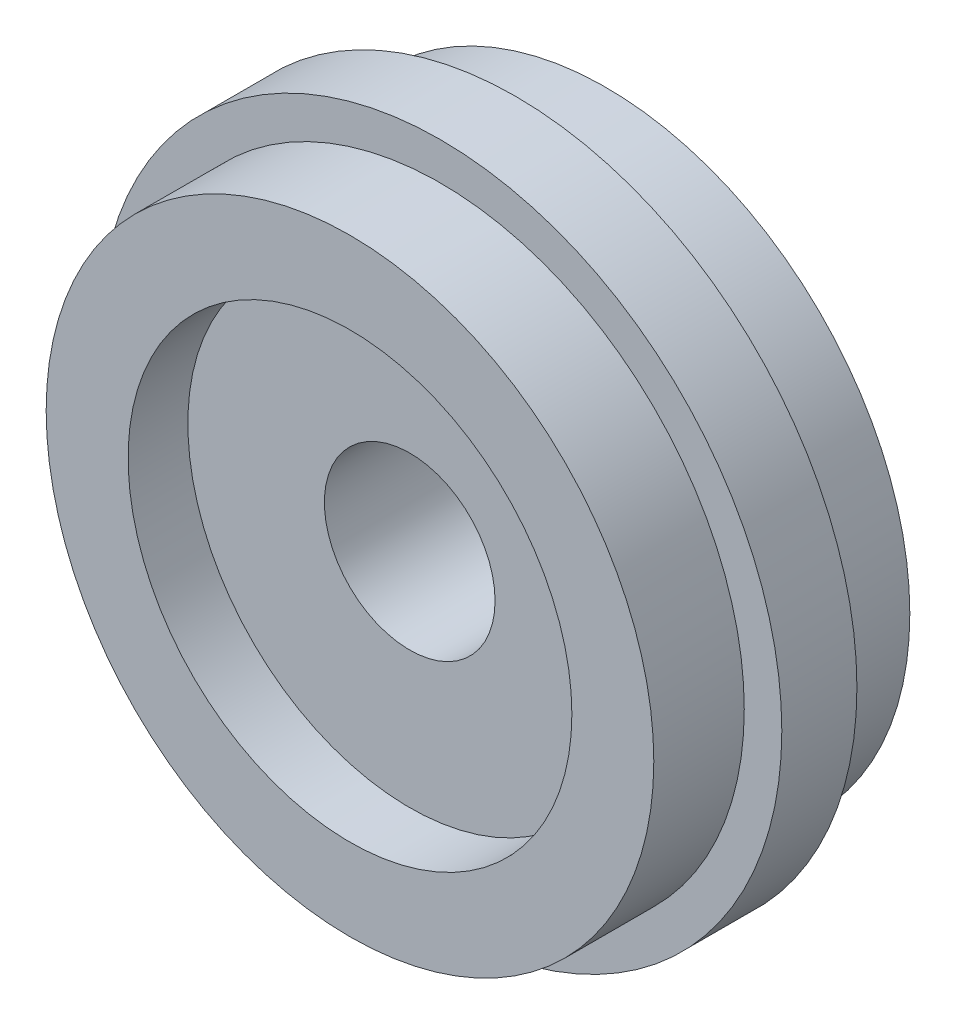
ISO-10303-21;
HEADER;
FILE_DESCRIPTION(('STEP AP214'),'2;1');
FILE_NAME('part.step','',(''),(''),'','','');
FILE_SCHEMA(('AUTOMOTIVE_DESIGN { 1 0 10303 214 1 1 1 1 }'));
ENDSEC;
DATA;
#1=APPLICATION_CONTEXT('core data for automotive mechanical design processes');
#2=APPLICATION_PROTOCOL_DEFINITION('international standard','automotive_design',2000,#1);
#3=PRODUCT_CONTEXT('',#1,'mechanical');
#4=PRODUCT('Part','Part','',(#3));
#5=PRODUCT_RELATED_PRODUCT_CATEGORY('part','',(#4));
#6=PRODUCT_DEFINITION_FORMATION('','',#4);
#7=PRODUCT_DEFINITION_CONTEXT('part definition',#1,'design');
#8=PRODUCT_DEFINITION('design','',#6,#7);
#9=PRODUCT_DEFINITION_SHAPE('','',#8);
#10=(LENGTH_UNIT() NAMED_UNIT(*) SI_UNIT(.MILLI.,.METRE.));
#11=(NAMED_UNIT(*) PLANE_ANGLE_UNIT() SI_UNIT($,.RADIAN.));
#12=(NAMED_UNIT(*) SI_UNIT($,.STERADIAN.) SOLID_ANGLE_UNIT());
#13=UNCERTAINTY_MEASURE_WITH_UNIT(LENGTH_MEASURE(1.E-05),#10,'distance_accuracy_value','');
#14=(GEOMETRIC_REPRESENTATION_CONTEXT(3) GLOBAL_UNCERTAINTY_ASSIGNED_CONTEXT((#13)) GLOBAL_UNIT_ASSIGNED_CONTEXT((#10,
#11,#12)) REPRESENTATION_CONTEXT('',''));
#15=CARTESIAN_POINT('',(0.,0.,0.));
#16=DIRECTION('',(0.,0.,1.));
#17=DIRECTION('',(1.,0.,0.));
#18=AXIS2_PLACEMENT_3D('',#15,#16,#17);
#19=CARTESIAN_POINT('',(0.,20.,7.5));
#20=DIRECTION('',(0.,0.,-1.));
#21=DIRECTION('',(-1.,0.,0.));
#22=AXIS2_PLACEMENT_3D('',#19,#20,#21);
#23=PLANE('',#22);
#24=CARTESIAN_POINT('',(0.,0.,7.5));
#25=DIRECTION('',(0.,0.,1.));
#26=DIRECTION('',(1.,0.,0.));
#27=AXIS2_PLACEMENT_3D('',#24,#25,#26);
#28=CIRCLE('',#27,13.);
#29=CARTESIAN_POINT('',(13.,0.,7.5));
#30=VERTEX_POINT('',#29);
#31=EDGE_CURVE('E8',#30,#30,#28,.T.);
#32=ORIENTED_EDGE('',*,*,#31,.F.);
#33=EDGE_LOOP('',(#32));
#34=FACE_BOUND('',#33,.T.);
#35=CARTESIAN_POINT('',(0.,0.,7.5));
#36=DIRECTION('',(0.,0.,-1.));
#37=DIRECTION('',(-1.,0.,0.));
#38=AXIS2_PLACEMENT_3D('',#35,#36,#37);
#39=CIRCLE('',#38,17.8);
#40=CARTESIAN_POINT('',(-17.8,0.,7.5));
#41=VERTEX_POINT('',#40);
#42=EDGE_CURVE('E15',#41,#41,#39,.T.);
#43=ORIENTED_EDGE('',*,*,#42,.F.);
#44=EDGE_LOOP('',(#43));
#45=FACE_BOUND('',#44,.T.);
#46=ADVANCED_FACE('F12',(#34,#45),#23,.F.);
#47=CARTESIAN_POINT('',(0.,11.,-7.5));
#48=DIRECTION('',(0.,0.,1.));
#49=DIRECTION('',(1.,0.,0.));
#50=AXIS2_PLACEMENT_3D('',#47,#48,#49);
#51=PLANE('',#50);
#52=CARTESIAN_POINT('',(0.,0.,-7.5));
#53=DIRECTION('',(0.,0.,1.));
#54=DIRECTION('',(1.,0.,0.));
#55=AXIS2_PLACEMENT_3D('',#52,#53,#54);
#56=CIRCLE('',#55,11.);
#57=CARTESIAN_POINT('',(11.,0.,-7.5));
#58=VERTEX_POINT('',#57);
#59=EDGE_CURVE('E33',#58,#58,#56,.T.);
#60=ORIENTED_EDGE('',*,*,#59,.T.);
#61=EDGE_LOOP('',(#60));
#62=FACE_BOUND('',#61,.T.);
#63=CARTESIAN_POINT('',(0.,0.,-7.5));
#64=DIRECTION('',(0.,0.,1.));
#65=DIRECTION('',(1.,0.,0.));
#66=AXIS2_PLACEMENT_3D('',#63,#64,#65);
#67=CIRCLE('',#66,17.8);
#68=CARTESIAN_POINT('',(17.8,0.,-7.5));
#69=VERTEX_POINT('',#68);
#70=EDGE_CURVE('E27',#69,#69,#67,.T.);
#71=ORIENTED_EDGE('',*,*,#70,.F.);
#72=EDGE_LOOP('',(#71));
#73=FACE_BOUND('',#72,.T.);
#74=ADVANCED_FACE('F64',(#62,#73),#51,.F.);
#75=CARTESIAN_POINT('',(0.,0.,6.9819902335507));
#76=DIRECTION('',(0.,0.,1.));
#77=DIRECTION('',(1.,0.,0.));
#78=AXIS2_PLACEMENT_3D('',#75,#76,#77);
#79=CYLINDRICAL_SURFACE('',#78,13.);
#80=CARTESIAN_POINT('',(0.,0.,4.));
#81=DIRECTION('',(0.,0.,1.));
#82=DIRECTION('',(1.,0.,0.));
#83=AXIS2_PLACEMENT_3D('',#80,#81,#82);
#84=CIRCLE('',#83,13.);
#85=CARTESIAN_POINT('',(13.,0.,4.));
#86=VERTEX_POINT('',#85);
#87=EDGE_CURVE('E19',#86,#86,#84,.T.);
#88=ORIENTED_EDGE('',*,*,#87,.F.);
#89=EDGE_LOOP('',(#88));
#90=FACE_BOUND('',#89,.T.);
#91=ORIENTED_EDGE('',*,*,#31,.T.);
#92=EDGE_LOOP('',(#91));
#93=FACE_BOUND('',#92,.T.);
#94=ADVANCED_FACE('F59',(#90,#93),#79,.F.);
#95=CARTESIAN_POINT('',(0.,13.,4.));
#96=DIRECTION('',(0.,0.,-1.));
#97=DIRECTION('',(-1.,0.,0.));
#98=AXIS2_PLACEMENT_3D('',#95,#96,#97);
#99=PLANE('',#98);
#100=CARTESIAN_POINT('',(0.,0.,4.));
#101=DIRECTION('',(0.,0.,1.));
#102=DIRECTION('',(1.,0.,0.));
#103=AXIS2_PLACEMENT_3D('',#100,#101,#102);
#104=CIRCLE('',#103,5.);
#105=CARTESIAN_POINT('',(5.,0.,4.));
#106=VERTEX_POINT('',#105);
#107=EDGE_CURVE('E24',#106,#106,#104,.T.);
#108=ORIENTED_EDGE('',*,*,#107,.F.);
#109=EDGE_LOOP('',(#108));
#110=FACE_BOUND('',#109,.T.);
#111=ORIENTED_EDGE('',*,*,#87,.T.);
#112=EDGE_LOOP('',(#111));
#113=FACE_BOUND('',#112,.T.);
#114=ADVANCED_FACE('F56',(#110,#113),#99,.F.);
#115=CARTESIAN_POINT('',(0.,0.,6.9819902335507));
#116=DIRECTION('',(0.,0.,1.));
#117=DIRECTION('',(1.,0.,0.));
#118=AXIS2_PLACEMENT_3D('',#115,#116,#117);
#119=CYLINDRICAL_SURFACE('',#118,5.);
#120=CARTESIAN_POINT('',(0.,0.,-4.));
#121=DIRECTION('',(0.,0.,1.));
#122=DIRECTION('',(1.,0.,0.));
#123=AXIS2_PLACEMENT_3D('',#120,#121,#122);
#124=CIRCLE('',#123,5.);
#125=CARTESIAN_POINT('',(5.,0.,-4.));
#126=VERTEX_POINT('',#125);
#127=EDGE_CURVE('E49',#126,#126,#124,.T.);
#128=ORIENTED_EDGE('',*,*,#127,.F.);
#129=EDGE_LOOP('',(#128));
#130=FACE_BOUND('',#129,.T.);
#131=ORIENTED_EDGE('',*,*,#107,.T.);
#132=EDGE_LOOP('',(#131));
#133=FACE_BOUND('',#132,.T.);
#134=ADVANCED_FACE('F54',(#130,#133),#119,.F.);
#135=CARTESIAN_POINT('',(0.,5.,-4.));
#136=DIRECTION('',(0.,0.,1.));
#137=DIRECTION('',(1.,0.,0.));
#138=AXIS2_PLACEMENT_3D('',#135,#136,#137);
#139=PLANE('',#138);
#140=CARTESIAN_POINT('',(0.,0.,-4.));
#141=DIRECTION('',(0.,0.,1.));
#142=DIRECTION('',(1.,0.,0.));
#143=AXIS2_PLACEMENT_3D('',#140,#141,#142);
#144=CIRCLE('',#143,11.);
#145=CARTESIAN_POINT('',(11.,0.,-4.));
#146=VERTEX_POINT('',#145);
#147=EDGE_CURVE('E46',#146,#146,#144,.T.);
#148=ORIENTED_EDGE('',*,*,#147,.F.);
#149=EDGE_LOOP('',(#148));
#150=FACE_BOUND('',#149,.T.);
#151=ORIENTED_EDGE('',*,*,#127,.T.);
#152=EDGE_LOOP('',(#151));
#153=FACE_BOUND('',#152,.T.);
#154=ADVANCED_FACE('F94',(#150,#153),#139,.F.);
#155=CARTESIAN_POINT('',(0.,0.,6.9819902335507));
#156=DIRECTION('',(0.,0.,1.));
#157=DIRECTION('',(1.,0.,0.));
#158=AXIS2_PLACEMENT_3D('',#155,#156,#157);
#159=CYLINDRICAL_SURFACE('',#158,11.);
#160=ORIENTED_EDGE('',*,*,#59,.F.);
#161=EDGE_LOOP('',(#160));
#162=FACE_BOUND('',#161,.T.);
#163=ORIENTED_EDGE('',*,*,#147,.T.);
#164=EDGE_LOOP('',(#163));
#165=FACE_BOUND('',#164,.T.);
#166=ADVANCED_FACE('F83',(#162,#165),#159,.F.);
#167=CARTESIAN_POINT('',(0.,0.,15.8253017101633));
#168=DIRECTION('',(0.,0.,1.));
#169=DIRECTION('',(1.,0.,0.));
#170=AXIS2_PLACEMENT_3D('',#167,#168,#169);
#171=CYLINDRICAL_SURFACE('',#170,17.8);
#172=CARTESIAN_POINT('',(0.,0.,2.2));
#173=DIRECTION('',(0.,0.,1.));
#174=DIRECTION('',(1.,0.,0.));
#175=AXIS2_PLACEMENT_3D('',#172,#173,#174);
#176=CIRCLE('',#175,17.8);
#177=CARTESIAN_POINT('',(17.8,0.,2.2));
#178=VERTEX_POINT('',#177);
#179=EDGE_CURVE('E40',#178,#178,#176,.T.);
#180=ORIENTED_EDGE('',*,*,#179,.T.);
#181=EDGE_LOOP('',(#180));
#182=FACE_BOUND('',#181,.T.);
#183=ORIENTED_EDGE('',*,*,#42,.T.);
#184=EDGE_LOOP('',(#183));
#185=FACE_BOUND('',#184,.T.);
#186=ADVANCED_FACE('F80',(#182,#185),#171,.T.);
#187=CARTESIAN_POINT('',(0.,0.,15.8253017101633));
#188=DIRECTION('',(0.,0.,1.));
#189=DIRECTION('',(1.,0.,0.));
#190=AXIS2_PLACEMENT_3D('',#187,#188,#189);
#191=CYLINDRICAL_SURFACE('',#190,17.8);
#192=CARTESIAN_POINT('',(0.,0.,-2.2));
#193=DIRECTION('',(0.,0.,1.));
#194=DIRECTION('',(1.,0.,0.));
#195=AXIS2_PLACEMENT_3D('',#192,#193,#194);
#196=CIRCLE('',#195,17.8);
#197=CARTESIAN_POINT('',(17.8,0.,-2.2));
#198=VERTEX_POINT('',#197);
#199=EDGE_CURVE('E35',#198,#198,#196,.T.);
#200=ORIENTED_EDGE('',*,*,#199,.F.);
#201=EDGE_LOOP('',(#200));
#202=FACE_BOUND('',#201,.T.);
#203=ORIENTED_EDGE('',*,*,#70,.T.);
#204=EDGE_LOOP('',(#203));
#205=FACE_BOUND('',#204,.T.);
#206=ADVANCED_FACE('F82',(#202,#205),#191,.T.);
#207=CARTESIAN_POINT('',(0.,0.,15.8253017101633));
#208=DIRECTION('',(0.,0.,1.));
#209=DIRECTION('',(1.,0.,0.));
#210=AXIS2_PLACEMENT_3D('',#207,#208,#209);
#211=CYLINDRICAL_SURFACE('',#210,20.);
#212=CARTESIAN_POINT('',(0.,0.,-2.2));
#213=DIRECTION('',(0.,0.,1.));
#214=DIRECTION('',(1.,0.,0.));
#215=AXIS2_PLACEMENT_3D('',#212,#213,#214);
#216=CIRCLE('',#215,20.);
#217=CARTESIAN_POINT('',(20.,0.,-2.2));
#218=VERTEX_POINT('',#217);
#219=EDGE_CURVE('E29',#218,#218,#216,.T.);
#220=ORIENTED_EDGE('',*,*,#219,.T.);
#221=EDGE_LOOP('',(#220));
#222=FACE_BOUND('',#221,.T.);
#223=CARTESIAN_POINT('',(0.,0.,2.2));
#224=DIRECTION('',(0.,0.,1.));
#225=DIRECTION('',(1.,0.,0.));
#226=AXIS2_PLACEMENT_3D('',#223,#224,#225);
#227=CIRCLE('',#226,20.);
#228=CARTESIAN_POINT('',(20.,0.,2.2));
#229=VERTEX_POINT('',#228);
#230=EDGE_CURVE('E189',#229,#229,#227,.T.);
#231=ORIENTED_EDGE('',*,*,#230,.F.);
#232=EDGE_LOOP('',(#231));
#233=FACE_BOUND('',#232,.T.);
#234=ADVANCED_FACE('F91',(#222,#233),#211,.T.);
#235=CARTESIAN_POINT('',(0.,17.8,-2.2));
#236=DIRECTION('',(0.,0.,-1.));
#237=DIRECTION('',(-1.,0.,0.));
#238=AXIS2_PLACEMENT_3D('',#235,#236,#237);
#239=PLANE('',#238);
#240=ORIENTED_EDGE('',*,*,#199,.T.);
#241=EDGE_LOOP('',(#240));
#242=FACE_BOUND('',#241,.T.);
#243=ORIENTED_EDGE('',*,*,#219,.F.);
#244=EDGE_LOOP('',(#243));
#245=FACE_BOUND('',#244,.T.);
#246=ADVANCED_FACE('F101',(#242,#245),#239,.T.);
#247=CARTESIAN_POINT('',(0.,20.,2.2));
#248=DIRECTION('',(0.,0.,1.));
#249=DIRECTION('',(1.,0.,0.));
#250=AXIS2_PLACEMENT_3D('',#247,#248,#249);
#251=PLANE('',#250);
#252=ORIENTED_EDGE('',*,*,#230,.T.);
#253=EDGE_LOOP('',(#252));
#254=FACE_BOUND('',#253,.T.);
#255=ORIENTED_EDGE('',*,*,#179,.F.);
#256=EDGE_LOOP('',(#255));
#257=FACE_BOUND('',#256,.T.);
#258=ADVANCED_FACE('F99',(#254,#257),#251,.T.);
#259=CLOSED_SHELL('',(#46,#74,#94,#114,#134,#154,#166,#186,#206,#234,#246,#258));
#260=MANIFOLD_SOLID_BREP('B1',#259);
#261=ADVANCED_BREP_SHAPE_REPRESENTATION('',(#18,#260),#14);
#262=SHAPE_DEFINITION_REPRESENTATION(#9,#261);
ENDSEC;
END-ISO-10303-21;
